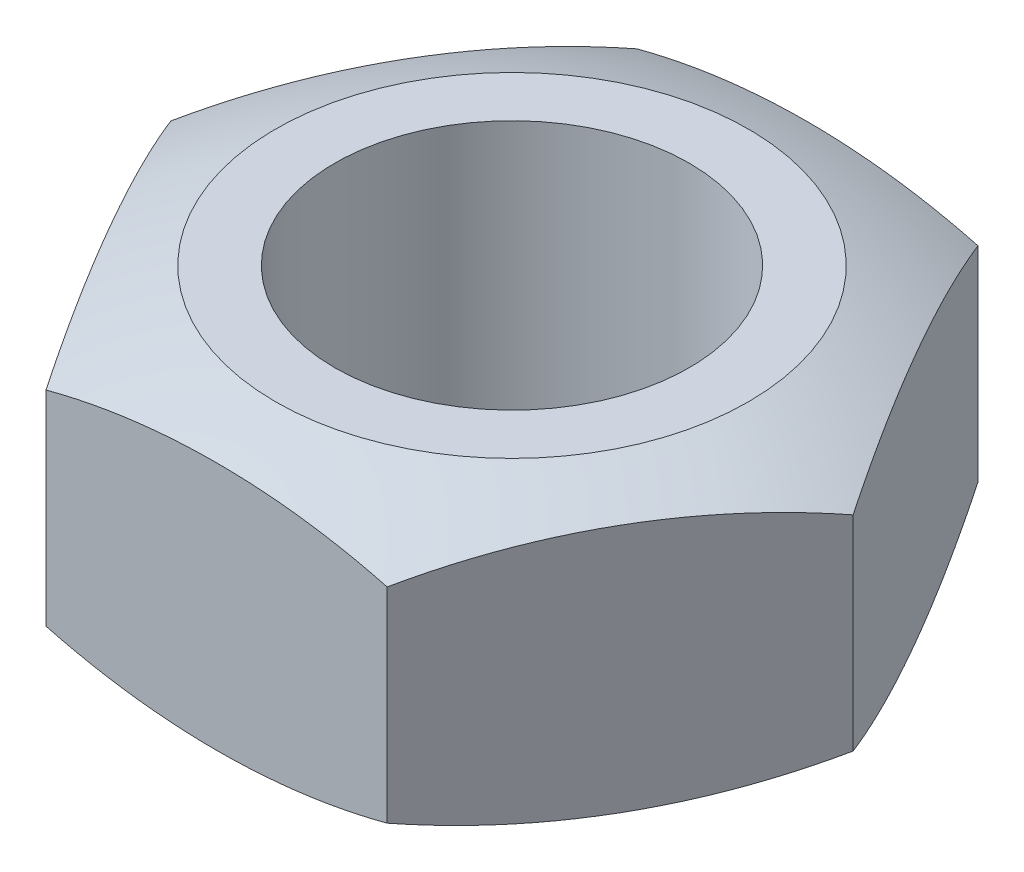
from build123d import *

# Parameters (mm, degrees)
BODY_DEPTH = 5
THREAD_R   = 3
HOLE_DEPTH = 10.128709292


with BuildPart() as part:
    # profile → body (new body)
    with BuildSketch(Plane(origin=(0, 0, 0), x_dir=(1, 0, 0), z_dir=(0, 1, 0))):
        Polygon((5.773502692, 0), (2.886751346, 5), (-2.886751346, 5), (-5.773502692, 0), (-2.886751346, -5), (2.886751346, -5), align=None)
    extrude(amount=BODY_DEPTH)

    # thread (on Top Plane) → hole (cut, through all)
    with BuildSketch(Plane(origin=(0, 0, 0), x_dir=(1, 0, 0), z_dir=(0, 1, 0))):
        with Locations(Location((0, 0, 0), (0, 0, 270))):
            Circle(THREAD_R)
    extrude(amount=HOLE_DEPTH, mode=Mode.SUBTRACT)

    # Sketch7 → fillet 2 (revolve, cut)
    with BuildSketch(Plane.XY):
        with BuildLine():
            Line((5.773502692, 4.23120945), (5.773502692, 0.76879055))
            ThreePointArc((5.773502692, 0.76879055), (2.974697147, -0.302787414), (0, -0.667161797))
            Line((0, -0.667161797), (0, -3.492163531))
            Line((0, -3.492163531), (6.272991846, -3.492163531))
            Line((6.272991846, -3.492163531), (6.272991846, 7.504587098))
            Line((6.272991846, 7.504587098), (0, 7.504587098))
            Line((0, 7.504587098), (0, 5.667161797))
            ThreePointArc((0, 5.667161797), (2.974697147, 5.302787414), (5.773502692, 4.23120945))
        make_face()
    revolve(axis=Axis((0, 0, 0), (0, 1, 0)), mode=Mode.SUBTRACT)


solid = part.part
